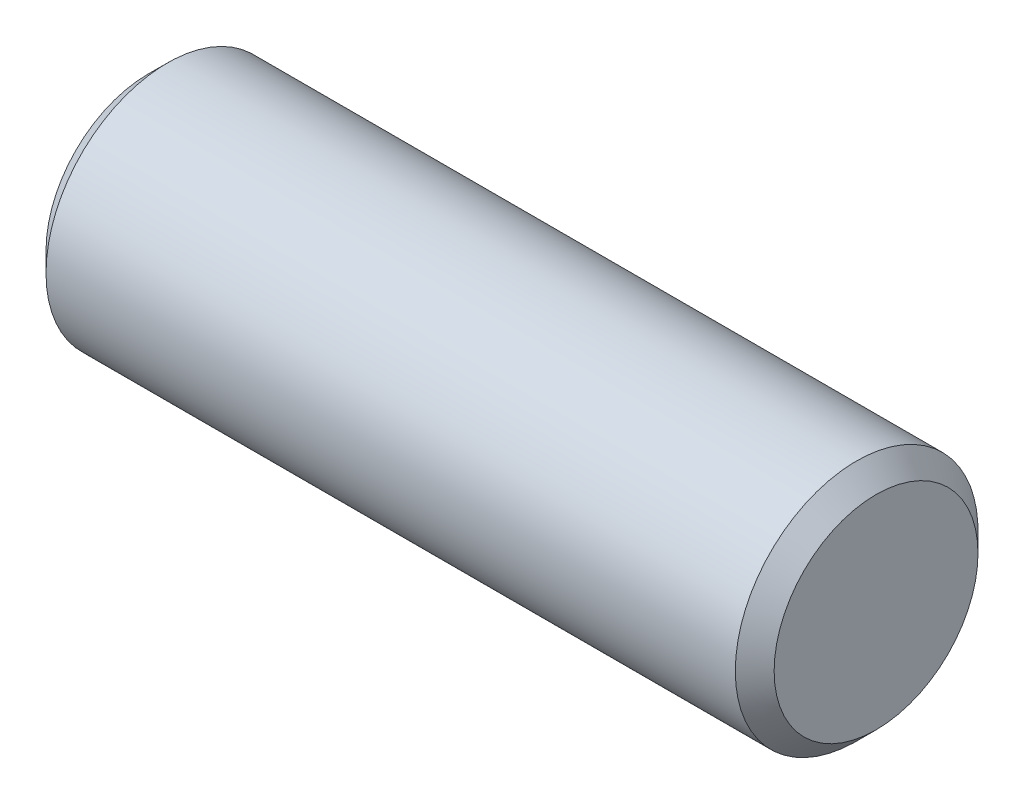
from build123d import *

# Parameters (mm, degrees)
SKETCH1_R          = 3.175
BASE_EXTRUDE_DEPTH = 9.525
CHAMFER1_SIZE      = 0.508


with BuildPart() as part:
    # Sketch1 → Base-Extrude (new, symmetric)
    with BuildSketch(Plane(origin=(0, 0, 0), x_dir=(0, 0, -1), z_dir=(1, 0, 0))):
        with Locations(Location((0, 0, 0), (0, 0, 180))):
            Circle(SKETCH1_R)
    extrude(amount=BASE_EXTRUDE_DEPTH, both=True)

    # Chamfer1
    chamfer1_edges = [part.edges().sort_by_distance(p)[0] for p in [
        (-9.525, 0, -3.175),
        (9.525, 0, -3.175),
    ]]
    chamfer(chamfer1_edges, length=CHAMFER1_SIZE)


solid = part.part
